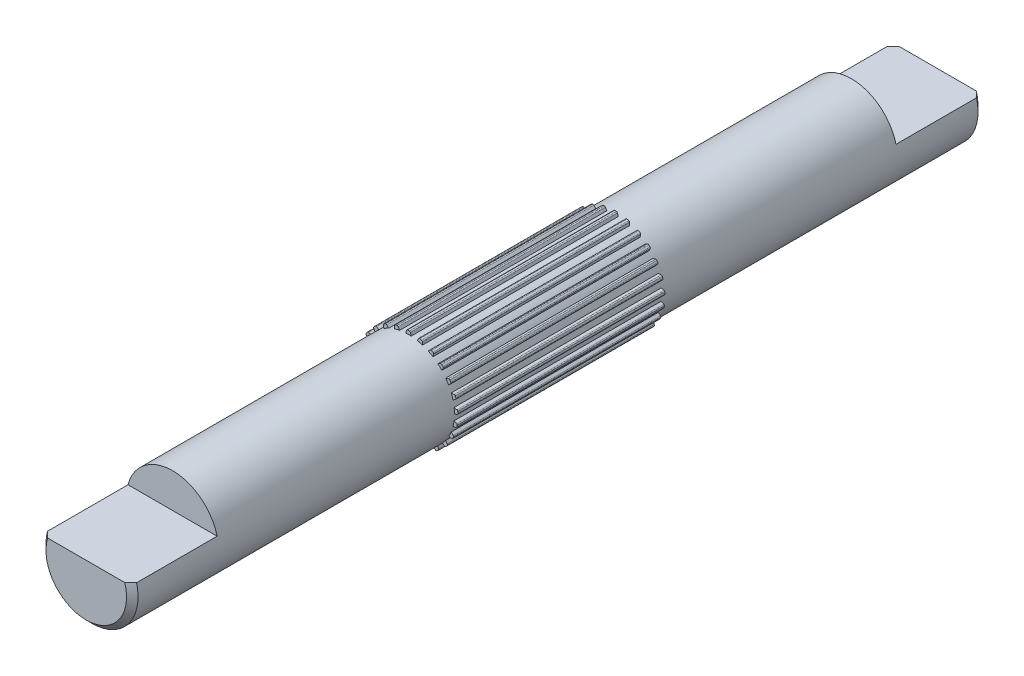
from build123d import *

# Parameters (mm, degrees)
ESQUISSE1_R                  = 4
EXTRUSION1_DEPTH             = 37
EXTRUSION2_DEPTH             = 9
R_P_TITION_CIRCULAIRE2_COUNT = 25
ESQUISSE4_W                  = 8.374546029
ESQUISSE4_H                  = 4.28145912
ENL_V_MAT_EXTRU_2_DEPTH      = 7.5
CHANFREIN1_SIZE              = 0.5


with BuildPart() as part:
    # Esquisse1 → Extrusion1 (new, symmetric)
    with BuildSketch(Plane.XY):
        with Locations(Location((0, 0, 0), (0, 0, 165.522487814))):
            Circle(ESQUISSE1_R)
    extrude(amount=EXTRUSION1_DEPTH, both=True)

    # Esquisse2 → Extrusion2 (add, symmetric)
    with BuildSketch(Plane.XY):
        with BuildLine():
            Line((-0.25, 3.947979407), (-0.170144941, 4.227472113))
            ThreePointArc((-0.170144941, 4.227472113), (-0.134212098, 4.279834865), (-0.073992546, 4.3))
            Line((-0.073992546, 4.3), (0.073992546, 4.3))
            ThreePointArc((0.073992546, 4.3), (0.134212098, 4.279834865), (0.170144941, 4.227472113))
            Line((0.170144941, 4.227472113), (0.25, 3.947979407))
            Line((0.25, 3.947979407), (-0.25, 3.947979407))
        make_face()
    extrusion2 = extrude(amount=EXTRUSION2_DEPTH, both=True)

    # R_p_tition circulaire2: Extrusion2 ×25 about axis
    r_p_tition_circulaire2_axis = Axis((0, 0, 0), (0, 0, 1))
    for i in range(1, R_P_TITION_CIRCULAIRE2_COUNT):
        add(extrusion2.rotate(r_p_tition_circulaire2_axis, i * 360 / R_P_TITION_CIRCULAIRE2_COUNT))

    # Esquisse4 → Enl_v. mat.-Extru.2 (cut)
    with BuildSketch(Plane.XY.offset(37)):
        with Locations((0.163699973, 3.14072956)):
            Rectangle(ESQUISSE4_W, ESQUISSE4_H)
    enl_v_mat_extru_2 = extrude(amount=-ENL_V_MAT_EXTRU_2_DEPTH, mode=Mode.SUBTRACT)

    # Sym_trie1: Enl_v. mat.-Extru.2 across plane
    add(enl_v_mat_extru_2.mirror(Plane.XY), mode=Mode.SUBTRACT)

    # Chanfrein1
    chanfrein1_edges = [part.edges().sort_by_distance(p)[0] for p in [
        (0, -4, 37),
        (0, -4, -37),
    ]]
    chamfer(chanfrein1_edges, length=CHANFREIN1_SIZE)


solid = part.part
